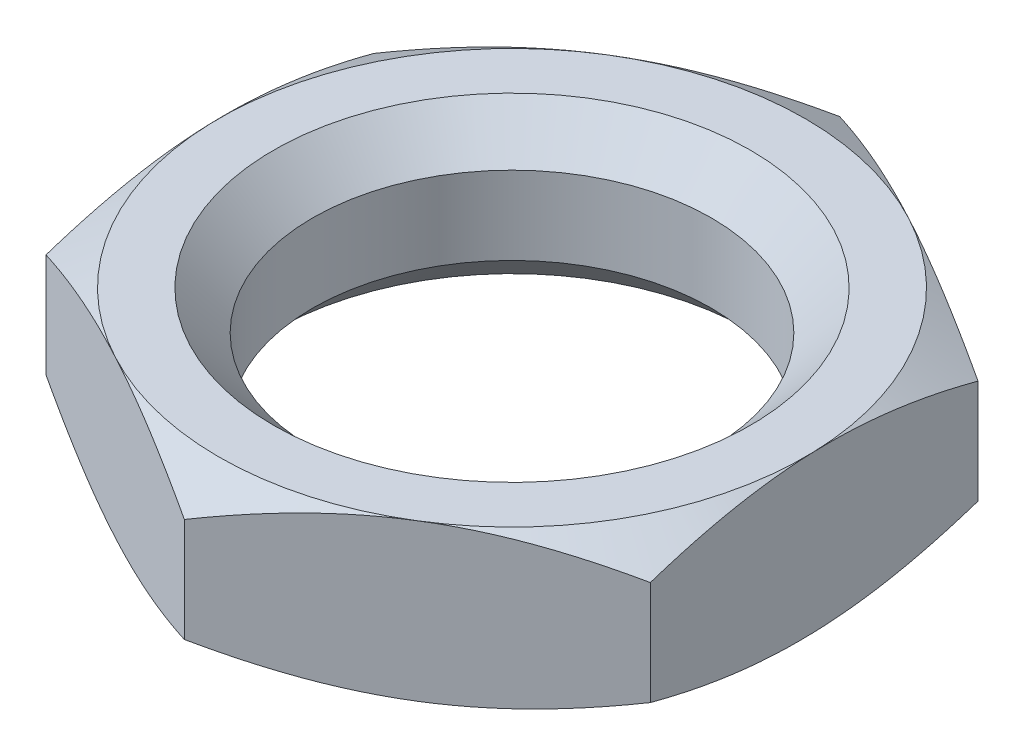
ISO-10303-21;
HEADER;
FILE_DESCRIPTION(('STEP AP214'),'2;1');
FILE_NAME('part.step','',(''),(''),'','','');
FILE_SCHEMA(('AUTOMOTIVE_DESIGN { 1 0 10303 214 1 1 1 1 }'));
ENDSEC;
DATA;
#1=APPLICATION_CONTEXT('core data for automotive mechanical design processes');
#2=APPLICATION_PROTOCOL_DEFINITION('international standard','automotive_design',2000,#1);
#3=PRODUCT_CONTEXT('',#1,'mechanical');
#4=PRODUCT('Part','Part','',(#3));
#5=PRODUCT_RELATED_PRODUCT_CATEGORY('part','',(#4));
#6=PRODUCT_DEFINITION_FORMATION('','',#4);
#7=PRODUCT_DEFINITION_CONTEXT('part definition',#1,'design');
#8=PRODUCT_DEFINITION('design','',#6,#7);
#9=PRODUCT_DEFINITION_SHAPE('','',#8);
#10=(LENGTH_UNIT() NAMED_UNIT(*) SI_UNIT(.MILLI.,.METRE.));
#11=(NAMED_UNIT(*) PLANE_ANGLE_UNIT() SI_UNIT($,.RADIAN.));
#12=(NAMED_UNIT(*) SI_UNIT($,.STERADIAN.) SOLID_ANGLE_UNIT());
#13=UNCERTAINTY_MEASURE_WITH_UNIT(LENGTH_MEASURE(1.E-05),#10,'distance_accuracy_value','');
#14=(GEOMETRIC_REPRESENTATION_CONTEXT(3) GLOBAL_UNCERTAINTY_ASSIGNED_CONTEXT((#13)) GLOBAL_UNIT_ASSIGNED_CONTEXT((#10,
#11,#12)) REPRESENTATION_CONTEXT('',''));
#15=CARTESIAN_POINT('',(0.,0.,0.));
#16=DIRECTION('',(0.,0.,1.));
#17=DIRECTION('',(1.,0.,0.));
#18=AXIS2_PLACEMENT_3D('',#15,#16,#17);
#19=CARTESIAN_POINT('',(7.63223412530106,4.,4.09255449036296));
#20=DIRECTION('',(-0.999507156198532,0.,0.0313917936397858));
#21=DIRECTION('',(0.0313917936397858,0.,0.999507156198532));
#22=AXIS2_PLACEMENT_3D('',#19,#20,#21);
#23=PLANE('',#22);
#24=CARTESIAN_POINT('',(7.36036693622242,0.669930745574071,-4.56363139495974));
#25=CARTESIAN_POINT('',(7.36634273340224,0.614986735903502,-4.37336345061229));
#26=CARTESIAN_POINT('',(7.37234081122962,0.56253632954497,-4.18238609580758));
#27=CARTESIAN_POINT('',(7.38438567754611,0.463309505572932,-3.79888045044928));
#28=CARTESIAN_POINT('',(7.39043248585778,0.416535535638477,-3.6063515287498));
#29=CARTESIAN_POINT('',(7.40866972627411,0.285646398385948,-3.02568218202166));
#30=CARTESIAN_POINT('',(7.42093214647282,0.211198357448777,-2.63524967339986));
#31=CARTESIAN_POINT('',(7.43928263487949,0.123899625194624,-2.05097453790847));
#32=CARTESIAN_POINT('',(7.44531587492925,0.099030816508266,-1.85887762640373));
#33=CARTESIAN_POINT('',(7.45740961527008,0.0573296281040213,-1.47381584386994));
#34=CARTESIAN_POINT('',(7.46347011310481,0.0404965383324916,-1.28085105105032));
#35=CARTESIAN_POINT('',(7.47560163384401,0.0152957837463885,-0.894586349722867));
#36=CARTESIAN_POINT('',(7.48167263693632,0.00691851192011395,-0.701287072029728));
#37=CARTESIAN_POINT('',(7.49381991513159,-0.00119996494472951,-0.314520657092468));
#38=CARTESIAN_POINT('',(7.49989619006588,-0.000941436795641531,-0.12105352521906));
#39=CARTESIAN_POINT('',(7.51654297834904,0.0116370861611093,0.408976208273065));
#40=CARTESIAN_POINT('',(7.52710804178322,0.0327508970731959,0.745365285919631));
#41=CARTESIAN_POINT('',(7.54816799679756,0.0997014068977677,1.41590918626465));
#42=CARTESIAN_POINT('',(7.5586628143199,0.145560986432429,1.75006165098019));
#43=CARTESIAN_POINT('',(7.57976514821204,0.260196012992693,2.42195488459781));
#44=CARTESIAN_POINT('',(7.59037000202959,0.329457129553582,2.75961087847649));
#45=CARTESIAN_POINT('',(7.61142156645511,0.486651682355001,3.42988762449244));
#46=CARTESIAN_POINT('',(7.62186854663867,0.574548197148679,3.76251695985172));
#47=CARTESIAN_POINT('',(7.63224040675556,0.669930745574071,4.09275449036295));
#48=B_SPLINE_CURVE_WITH_KNOTS('',3,(#24,#25,#26,#27,#28,#29,#30,#31,#32,#33,#34,#35,#36,#37,#38,
#39,#40,#41,#42,#43,#44,#45,#46,#47),.UNSPECIFIED.,.F.,.F.,(4,2,2,2,2,2,2,2,2,2,2,4),(0.,
0.594349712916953,1.18895480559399,2.38063565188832,2.96188168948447,3.54307635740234,
4.12360995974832,4.70412562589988,5.71471502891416,6.72624045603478,7.76019940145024,
8.79212864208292),.UNSPECIFIED.);
#49=CARTESIAN_POINT('',(7.36037321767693,0.669872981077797,-4.56343139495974));
#50=VERTEX_POINT('',#49);
#51=CARTESIAN_POINT('',(7.49630367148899,0.,-0.235438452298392));
#52=VERTEX_POINT('',#51);
#53=EDGE_CURVE('E364',#50,#52,#48,.T.);
#54=ORIENTED_EDGE('',*,*,#53,.F.);
#55=DIRECTION('',(0.,-1.,0.));
#56=VECTOR('',#55,1.);
#57=CARTESIAN_POINT('',(7.36037321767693,4.,-4.56343139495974));
#58=LINE('',#57,#56);
#59=CARTESIAN_POINT('',(7.36037321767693,3.3301270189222,-4.56343139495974));
#60=VERTEX_POINT('',#59);
#61=EDGE_CURVE('E481',#60,#50,#58,.T.);
#62=ORIENTED_EDGE('',*,*,#61,.F.);
#63=CARTESIAN_POINT('',(7.63224040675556,3.33006925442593,4.09275449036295));
#64=CARTESIAN_POINT('',(7.62626460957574,3.3850132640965,3.90248654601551));
#65=CARTESIAN_POINT('',(7.62026653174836,3.43746367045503,3.71150919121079));
#66=CARTESIAN_POINT('',(7.60822166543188,3.53669049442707,3.3280035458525));
#67=CARTESIAN_POINT('',(7.6021748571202,3.58346446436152,3.13547462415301));
#68=CARTESIAN_POINT('',(7.58393761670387,3.71435360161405,2.55480527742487));
#69=CARTESIAN_POINT('',(7.57167519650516,3.78880164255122,2.16437276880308));
#70=CARTESIAN_POINT('',(7.55332470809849,3.87610037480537,1.58009763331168));
#71=CARTESIAN_POINT('',(7.54729146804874,3.90096918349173,1.38800072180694));
#72=CARTESIAN_POINT('',(7.5351977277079,3.94267037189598,1.00293893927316));
#73=CARTESIAN_POINT('',(7.52913722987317,3.95950346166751,0.809974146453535));
#74=CARTESIAN_POINT('',(7.51700570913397,3.98470421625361,0.423709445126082));
#75=CARTESIAN_POINT('',(7.51093470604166,3.99308148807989,0.230410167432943));
#76=CARTESIAN_POINT('',(7.49878742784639,4.00119996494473,-0.156356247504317));
#77=CARTESIAN_POINT('',(7.4927111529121,4.00094143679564,-0.349823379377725));
#78=CARTESIAN_POINT('',(7.47606436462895,3.98836291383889,-0.879853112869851));
#79=CARTESIAN_POINT('',(7.46549930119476,3.9672491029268,-1.21624219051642));
#80=CARTESIAN_POINT('',(7.44443934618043,3.90029859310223,-1.88678609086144));
#81=CARTESIAN_POINT('',(7.43394452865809,3.85443901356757,-2.22093855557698));
#82=CARTESIAN_POINT('',(7.41284219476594,3.7398039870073,-2.8928317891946));
#83=CARTESIAN_POINT('',(7.40223734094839,3.67054287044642,-3.23048778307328));
#84=CARTESIAN_POINT('',(7.38118577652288,3.513348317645,-3.90076452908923));
#85=CARTESIAN_POINT('',(7.37073879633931,3.42545180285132,-4.23339386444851));
#86=CARTESIAN_POINT('',(7.36036693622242,3.33006925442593,-4.56363139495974));
#87=B_SPLINE_CURVE_WITH_KNOTS('',3,(#63,#64,#65,#66,#67,#68,#69,#70,#71,#72,#73,#74,#75,#76,#77,
#78,#79,#80,#81,#82,#83,#84,#85,#86),.UNSPECIFIED.,.F.,.F.,(4,2,2,2,2,2,2,2,2,2,2,4),(0.,
0.594349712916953,1.18895480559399,2.38063565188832,2.96188168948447,3.54307635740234,
4.12360995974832,4.70412562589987,5.71471502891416,6.72624045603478,7.76019940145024,
8.79212864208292),.UNSPECIFIED.);
#88=CARTESIAN_POINT('',(7.49630367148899,4.,-0.235438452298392));
#89=VERTEX_POINT('',#88);
#90=EDGE_CURVE('E578',#89,#60,#87,.T.);
#91=ORIENTED_EDGE('',*,*,#90,.F.);
#92=CARTESIAN_POINT('',(7.63223412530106,3.3301270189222,4.09255449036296));
#93=VERTEX_POINT('',#92);
#94=EDGE_CURVE('E472',#93,#89,#87,.T.);
#95=ORIENTED_EDGE('',*,*,#94,.F.);
#96=DIRECTION('',(0.,-1.,0.));
#97=VECTOR('',#96,1.);
#98=CARTESIAN_POINT('',(7.63223412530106,4.,4.09255449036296));
#99=LINE('',#98,#97);
#100=CARTESIAN_POINT('',(7.63223412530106,0.669872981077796,4.09255449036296));
#101=VERTEX_POINT('',#100);
#102=EDGE_CURVE('E467',#93,#101,#99,.T.);
#103=ORIENTED_EDGE('',*,*,#102,.T.);
#104=EDGE_CURVE('E459',#52,#101,#48,.T.);
#105=ORIENTED_EDGE('',*,*,#104,.F.);
#106=EDGE_LOOP('',(#54,#62,#91,#95,#103,#105));
#107=FACE_BOUND('',#106,.T.);
#108=ADVANCED_FACE('F348',(#107),#23,.F.);
#109=CARTESIAN_POINT('',(7.36037321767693,4.,-4.56343139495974));
#110=DIRECTION('',(-0.472567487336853,0.,0.881294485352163));
#111=DIRECTION('',(0.881294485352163,0.,0.472567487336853));
#112=AXIS2_PLACEMENT_3D('',#109,#110,#111);
#113=PLANE('',#112);
#114=CARTESIAN_POINT('',(-0.272060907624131,0.669938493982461,-8.65609312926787));
#115=CARTESIAN_POINT('',(-0.104295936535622,0.61499416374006,-8.56613424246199));
#116=CARTESIAN_POINT('',(0.0640945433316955,0.562543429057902,-8.47583994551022));
#117=CARTESIAN_POINT('',(0.402243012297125,0.463315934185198,-8.29451806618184));
#118=CARTESIAN_POINT('',(0.572001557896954,0.416541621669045,-8.20349018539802));
#119=CARTESIAN_POINT('',(1.08399521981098,0.285651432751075,-7.92894908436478));
#120=CARTESIAN_POINT('',(1.42825134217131,0.211202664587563,-7.74435216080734));
#121=CARTESIAN_POINT('',(1.9434243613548,0.123902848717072,-7.46810622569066));
#122=CARTESIAN_POINT('',(2.11280199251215,0.0990336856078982,-7.37728259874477));
#123=CARTESIAN_POINT('',(2.45232257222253,0.0573317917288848,-7.19522496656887));
#124=CARTESIAN_POINT('',(2.62246545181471,0.0404983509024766,-7.10399099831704));
#125=CARTESIAN_POINT('',(2.96304670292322,0.0152969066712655,-6.92136461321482));
#126=CARTESIAN_POINT('',(3.13348451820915,0.00691929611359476,-6.82997249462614));
#127=CARTESIAN_POINT('',(3.47450816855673,-0.00119983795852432,-6.64710888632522));
#128=CARTESIAN_POINT('',(3.64509399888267,-0.000941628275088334,-6.55563739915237));
#129=CARTESIAN_POINT('',(4.11244035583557,0.0116361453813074,-6.30503706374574));
#130=CARTESIAN_POINT('',(4.40904788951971,0.0327498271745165,-6.14599025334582));
#131=CARTESIAN_POINT('',(5.00029292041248,0.099700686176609,-5.82895300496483));
#132=CARTESIAN_POINT('',(5.29492833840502,0.145560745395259,-5.67096368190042));
#133=CARTESIAN_POINT('',(5.88736318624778,0.260197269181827,-5.35328843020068));
#134=CARTESIAN_POINT('',(6.18508786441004,0.329459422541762,-5.19364258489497));
#135=CARTESIAN_POINT('',(6.77609738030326,0.486656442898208,-4.87673162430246));
#136=CARTESIAN_POINT('',(7.06938978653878,0.574554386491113,-4.71946245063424));
#137=CARTESIAN_POINT('',(7.36057321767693,0.669938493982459,-4.56332415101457));
#138=B_SPLINE_CURVE_WITH_KNOTS('',3,(#114,#115,#116,#117,#118,#119,#120,#121,#122,#123,#124,
#125,#126,#127,#128,#129,#130,#131,#132,#133,#134,#135,#136,#137),.UNSPECIFIED.,.F.,.F.,(4,2,2,
2,2,2,2,2,2,2,2,4),(0.,0.594350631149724,1.18895664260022,2.380639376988,2.96188624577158,
3.54308174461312,4.12361616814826,4.70413265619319,5.71473393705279,6.72627128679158,
7.76024278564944,8.79218449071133),.UNSPECIFIED.);
#139=CARTESIAN_POINT('',(-0.271860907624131,0.669872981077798,-8.65598588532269));
#140=VERTEX_POINT('',#139);
#141=CARTESIAN_POINT('',(3.5442561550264,0.,-6.60970864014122));
#142=VERTEX_POINT('',#141);
#143=EDGE_CURVE('E371',#140,#142,#138,.T.);
#144=ORIENTED_EDGE('',*,*,#143,.F.);
#145=DIRECTION('',(0.,-1.,0.));
#146=VECTOR('',#145,1.);
#147=CARTESIAN_POINT('',(-0.271860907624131,4.,-8.65598588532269));
#148=LINE('',#147,#146);
#149=CARTESIAN_POINT('',(-0.271860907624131,3.3301270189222,-8.65598588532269));
#150=VERTEX_POINT('',#149);
#151=EDGE_CURVE('E478',#150,#140,#148,.T.);
#152=ORIENTED_EDGE('',*,*,#151,.F.);
#153=CARTESIAN_POINT('',(7.36057321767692,3.33006150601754,-4.56332415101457));
#154=CARTESIAN_POINT('',(7.19280824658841,3.38500583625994,-4.65328303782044));
#155=CARTESIAN_POINT('',(7.0244177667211,3.4374565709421,-4.74357733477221));
#156=CARTESIAN_POINT('',(6.68626929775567,3.5366840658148,-4.9248992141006));
#157=CARTESIAN_POINT('',(6.51651075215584,3.58345837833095,-5.01592709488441));
#158=CARTESIAN_POINT('',(6.00451709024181,3.71434856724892,-5.29046819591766));
#159=CARTESIAN_POINT('',(5.66026096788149,3.78879733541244,-5.4750651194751));
#160=CARTESIAN_POINT('',(5.14508794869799,3.87609715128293,-5.75131105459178));
#161=CARTESIAN_POINT('',(4.97571031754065,3.9009663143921,-5.84213468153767));
#162=CARTESIAN_POINT('',(4.63618973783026,3.94266820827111,-6.02419231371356));
#163=CARTESIAN_POINT('',(4.46604685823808,3.95950164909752,-6.11542628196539));
#164=CARTESIAN_POINT('',(4.12546560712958,3.98470309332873,-6.29805266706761));
#165=CARTESIAN_POINT('',(3.95502779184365,3.9930807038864,-6.3894447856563));
#166=CARTESIAN_POINT('',(3.61400414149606,4.00119983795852,-6.57230839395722));
#167=CARTESIAN_POINT('',(3.44341831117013,4.00094162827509,-6.66377988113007));
#168=CARTESIAN_POINT('',(2.97607195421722,3.98836385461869,-6.9143802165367));
#169=CARTESIAN_POINT('',(2.67946442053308,3.96725017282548,-7.07342702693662));
#170=CARTESIAN_POINT('',(2.08821938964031,3.90029931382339,-7.39046427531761));
#171=CARTESIAN_POINT('',(1.79358397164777,3.85443925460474,-7.54845359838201));
#172=CARTESIAN_POINT('',(1.20114912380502,3.73980273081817,-7.86612885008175));
#173=CARTESIAN_POINT('',(0.903424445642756,3.67054057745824,-8.02577469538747));
#174=CARTESIAN_POINT('',(0.312414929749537,3.51334355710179,-8.34268565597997));
#175=CARTESIAN_POINT('',(0.0191225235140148,3.42544561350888,-8.4999548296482));
#176=CARTESIAN_POINT('',(-0.272060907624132,3.33006150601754,-8.65609312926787));
#177=B_SPLINE_CURVE_WITH_KNOTS('',3,(#153,#154,#155,#156,#157,#158,#159,#160,#161,#162,#163,
#164,#165,#166,#167,#168,#169,#170,#171,#172,#173,#174,#175,#176),.UNSPECIFIED.,.F.,.F.,(4,2,2,
2,2,2,2,2,2,2,2,4),(0.,0.594350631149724,1.18895664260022,2.380639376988,2.96188624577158,
3.54308174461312,4.12361616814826,4.70413265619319,5.71473393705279,6.72627128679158,
7.76024278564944,8.79218449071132),.UNSPECIFIED.);
#178=CARTESIAN_POINT('',(3.5442561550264,4.,-6.60970864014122));
#179=VERTEX_POINT('',#178);
#180=EDGE_CURVE('E572',#179,#150,#177,.T.);
#181=ORIENTED_EDGE('',*,*,#180,.F.);
#182=EDGE_CURVE('E576',#60,#179,#177,.T.);
#183=ORIENTED_EDGE('',*,*,#182,.F.);
#184=ORIENTED_EDGE('',*,*,#61,.T.);
#185=EDGE_CURVE('E590',#142,#50,#138,.T.);
#186=ORIENTED_EDGE('',*,*,#185,.F.);
#187=EDGE_LOOP('',(#144,#152,#181,#183,#184,#186));
#188=FACE_BOUND('',#187,.T.);
#189=ADVANCED_FACE('F582',(#188),#113,.F.);
#190=CARTESIAN_POINT('',(-0.271860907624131,4.,-8.65598588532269));
#191=DIRECTION('',(0.526939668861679,0.,0.849902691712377));
#192=DIRECTION('',(0.849902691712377,0.,-0.526939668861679));
#193=AXIS2_PLACEMENT_3D('',#190,#191,#192);
#194=PLANE('',#193);
#195=CARTESIAN_POINT('',(-7.63243412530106,0.669940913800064,-4.09243049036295));
#196=CARTESIAN_POINT('',(-7.47064489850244,0.614996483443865,-4.1927398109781));
#197=CARTESIAN_POINT('',(-7.30825244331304,0.562545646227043,-4.29342313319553));
#198=CARTESIAN_POINT('',(-6.98214873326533,0.4633179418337,-4.49560743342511));
#199=CARTESIAN_POINT('',(-6.81843694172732,0.416543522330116,-4.59710874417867));
#200=CARTESIAN_POINT('',(-6.32468035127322,0.285653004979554,-4.90323783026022));
#201=CARTESIAN_POINT('',(-5.99268653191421,0.211204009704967,-5.10907399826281));
#202=CARTESIAN_POINT('',(-5.495863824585,0.123903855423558,-5.41710407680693));
#203=CARTESIAN_POINT('',(-5.33251937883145,0.0990345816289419,-5.51837763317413));
#204=CARTESIAN_POINT('',(-5.00509242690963,0.0573324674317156,-5.72138234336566));
#205=CARTESIAN_POINT('',(-4.84100998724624,0.0404989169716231,-5.82311345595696));
#206=CARTESIAN_POINT('',(-4.51256013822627,0.0152972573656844,-6.02675236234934));
#207=CARTESIAN_POINT('',(-4.34819326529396,0.00691954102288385,-6.12865982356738));
#208=CARTESIAN_POINT('',(-4.01931676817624,-0.00119979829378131,-6.33256325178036));
#209=CARTESIAN_POINT('',(-3.85480714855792,-0.000941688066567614,-6.43455921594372));
#210=CARTESIAN_POINT('',(-3.40410658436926,0.0116358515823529,-6.7139935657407));
#211=CARTESIAN_POINT('',(-3.11806318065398,0.0327494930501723,-6.89134047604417));
#212=CARTESIAN_POINT('',(-2.54787624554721,0.0997004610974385,-7.24485637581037));
#213=CARTESIAN_POINT('',(-2.26373471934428,0.145560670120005,-7.42102412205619));
#214=CARTESIAN_POINT('',(-1.69240032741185,0.260197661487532,-7.7752514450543));
#215=CARTESIAN_POINT('',(-1.40527955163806,0.32946013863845,-7.95326632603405));
#216=CARTESIAN_POINT('',(-0.835319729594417,0.486657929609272,-8.30664141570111));
#217=CARTESIAN_POINT('',(-0.552473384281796,0.574556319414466,-8.48200614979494));
#218=CARTESIAN_POINT('',(-0.27166090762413,0.669940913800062,-8.6561098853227));
#219=B_SPLINE_CURVE_WITH_KNOTS('',3,(#195,#196,#197,#198,#199,#200,#201,#202,#203,#204,#205,
#206,#207,#208,#209,#210,#211,#212,#213,#214,#215,#216,#217,#218),.UNSPECIFIED.,.F.,.F.,(4,2,2,
2,2,2,2,2,2,2,2,4),(0.,0.594350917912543,1.18895721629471,2.38064054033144,2.96188766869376,
3.54308342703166,4.12361810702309,4.70413485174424,5.71473984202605,6.72628091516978,
7.76025633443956,8.79220193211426),.UNSPECIFIED.);
#220=CARTESIAN_POINT('',(-7.63223412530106,0.6698729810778,-4.09255449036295));
#221=VERTEX_POINT('',#220);
#222=CARTESIAN_POINT('',(-3.95204751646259,0.,-6.37427018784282));
#223=VERTEX_POINT('',#222);
#224=EDGE_CURVE('E605',#221,#223,#219,.T.);
#225=ORIENTED_EDGE('',*,*,#224,.F.);
#226=DIRECTION('',(0.,-1.,0.));
#227=VECTOR('',#226,1.);
#228=CARTESIAN_POINT('',(-7.63223412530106,4.,-4.09255449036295));
#229=LINE('',#228,#227);
#230=CARTESIAN_POINT('',(-7.63223412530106,3.3301270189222,-4.09255449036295));
#231=VERTEX_POINT('',#230);
#232=EDGE_CURVE('E469',#231,#221,#229,.T.);
#233=ORIENTED_EDGE('',*,*,#232,.F.);
#234=CARTESIAN_POINT('',(-0.271660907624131,3.33005908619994,-8.6561098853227));
#235=CARTESIAN_POINT('',(-0.433450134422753,3.38500351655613,-8.55580056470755));
#236=CARTESIAN_POINT('',(-0.595842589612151,3.43745435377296,-8.45511724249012));
#237=CARTESIAN_POINT('',(-0.921946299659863,3.5366820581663,-8.25293294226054));
#238=CARTESIAN_POINT('',(-1.08565809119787,3.58345647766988,-8.15143163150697));
#239=CARTESIAN_POINT('',(-1.57941468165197,3.71434699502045,-7.84530254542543));
#240=CARTESIAN_POINT('',(-1.91140850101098,3.78879599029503,-7.63946637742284));
#241=CARTESIAN_POINT('',(-2.40823120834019,3.87609614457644,-7.33143629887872));
#242=CARTESIAN_POINT('',(-2.57157565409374,3.90096541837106,-7.23016274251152));
#243=CARTESIAN_POINT('',(-2.89900260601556,3.94266753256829,-7.02715803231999));
#244=CARTESIAN_POINT('',(-3.06308504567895,3.95950108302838,-6.92542691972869));
#245=CARTESIAN_POINT('',(-3.39153489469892,3.98470274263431,-6.72178801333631));
#246=CARTESIAN_POINT('',(-3.55590176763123,3.99308045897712,-6.61988055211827));
#247=CARTESIAN_POINT('',(-3.88477826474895,4.00119979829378,-6.41597712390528));
#248=CARTESIAN_POINT('',(-4.04928788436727,4.00094168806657,-6.31398115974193));
#249=CARTESIAN_POINT('',(-4.49998844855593,3.98836414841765,-6.03454680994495));
#250=CARTESIAN_POINT('',(-4.7860318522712,3.96725050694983,-5.85719989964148));
#251=CARTESIAN_POINT('',(-5.35621878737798,3.90029953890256,-5.50368399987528));
#252=CARTESIAN_POINT('',(-5.6403603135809,3.85443932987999,-5.32751625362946));
#253=CARTESIAN_POINT('',(-6.21169470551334,3.73980233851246,-4.97328893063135));
#254=CARTESIAN_POINT('',(-6.49881548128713,3.67053986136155,-4.7952740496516));
#255=CARTESIAN_POINT('',(-7.06877530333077,3.51334207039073,-4.44189895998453));
#256=CARTESIAN_POINT('',(-7.35162164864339,3.42544368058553,-4.26653422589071));
#257=CARTESIAN_POINT('',(-7.63243412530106,3.33005908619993,-4.09243049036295));
#258=B_SPLINE_CURVE_WITH_KNOTS('',3,(#234,#235,#236,#237,#238,#239,#240,#241,#242,#243,#244,
#245,#246,#247,#248,#249,#250,#251,#252,#253,#254,#255,#256,#257),.UNSPECIFIED.,.F.,.F.,(4,2,2,
2,2,2,2,2,2,2,2,4),(0.,0.594350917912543,1.18895721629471,2.38064054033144,2.96188766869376,
3.54308342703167,4.12361810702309,4.70413485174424,5.71473984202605,6.72628091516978,
7.76025633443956,8.79220193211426),.UNSPECIFIED.);
#259=CARTESIAN_POINT('',(-3.95204751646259,4.,-6.37427018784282));
#260=VERTEX_POINT('',#259);
#261=EDGE_CURVE('E529',#260,#231,#258,.T.);
#262=ORIENTED_EDGE('',*,*,#261,.F.);
#263=EDGE_CURVE('E577',#150,#260,#258,.T.);
#264=ORIENTED_EDGE('',*,*,#263,.F.);
#265=ORIENTED_EDGE('',*,*,#151,.T.);
#266=EDGE_CURVE('E601',#223,#140,#219,.T.);
#267=ORIENTED_EDGE('',*,*,#266,.F.);
#268=EDGE_LOOP('',(#225,#233,#262,#264,#265,#267));
#269=FACE_BOUND('',#268,.T.);
#270=ADVANCED_FACE('F585',(#269),#194,.F.);
#271=CARTESIAN_POINT('',(-7.63223412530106,4.,-4.09255449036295));
#272=DIRECTION('',(0.999507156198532,0.,-0.031391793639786));
#273=DIRECTION('',(-0.031391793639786,0.,-0.999507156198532));
#274=AXIS2_PLACEMENT_3D('',#271,#272,#273);
#275=PLANE('',#274);
#276=CARTESIAN_POINT('',(-7.36036693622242,0.669930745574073,4.56363139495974));
#277=CARTESIAN_POINT('',(-7.36634273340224,0.614986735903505,4.3733634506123));
#278=CARTESIAN_POINT('',(-7.37234081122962,0.562536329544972,4.18238609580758));
#279=CARTESIAN_POINT('',(-7.3843856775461,0.463309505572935,3.79888045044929));
#280=CARTESIAN_POINT('',(-7.39043248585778,0.416535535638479,3.6063515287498));
#281=CARTESIAN_POINT('',(-7.40866972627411,0.285646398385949,3.02568218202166));
#282=CARTESIAN_POINT('',(-7.42093214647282,0.211198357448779,2.63524967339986));
#283=CARTESIAN_POINT('',(-7.43928263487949,0.123899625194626,2.05097453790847));
#284=CARTESIAN_POINT('',(-7.44531587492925,0.0990308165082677,1.85887762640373));
#285=CARTESIAN_POINT('',(-7.45740961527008,0.0573296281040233,1.47381584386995));
#286=CARTESIAN_POINT('',(-7.46347011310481,0.0404965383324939,1.28085105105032));
#287=CARTESIAN_POINT('',(-7.47560163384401,0.0152957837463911,0.894586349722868));
#288=CARTESIAN_POINT('',(-7.48167263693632,0.0069185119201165,0.70128707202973));
#289=CARTESIAN_POINT('',(-7.49381991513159,-0.00119996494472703,0.314520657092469));
#290=CARTESIAN_POINT('',(-7.49989619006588,-0.000941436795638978,0.121053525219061));
#291=CARTESIAN_POINT('',(-7.51654297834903,0.011637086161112,-0.408976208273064));
#292=CARTESIAN_POINT('',(-7.52710804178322,0.0327508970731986,-0.74536528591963));
#293=CARTESIAN_POINT('',(-7.54816799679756,0.0997014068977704,-1.41590918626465));
#294=CARTESIAN_POINT('',(-7.55866281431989,0.145560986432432,-1.75006165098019));
#295=CARTESIAN_POINT('',(-7.57976514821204,0.260196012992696,-2.42195488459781));
#296=CARTESIAN_POINT('',(-7.59037000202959,0.329457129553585,-2.75961087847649));
#297=CARTESIAN_POINT('',(-7.61142156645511,0.486651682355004,-3.42988762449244));
#298=CARTESIAN_POINT('',(-7.62186854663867,0.574548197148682,-3.76251695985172));
#299=CARTESIAN_POINT('',(-7.63224040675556,0.669930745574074,-4.09275449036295));
#300=B_SPLINE_CURVE_WITH_KNOTS('',3,(#276,#277,#278,#279,#280,#281,#282,#283,#284,#285,#286,
#287,#288,#289,#290,#291,#292,#293,#294,#295,#296,#297,#298,#299),.UNSPECIFIED.,.F.,.F.,(4,2,2,
2,2,2,2,2,2,2,2,4),(0.,0.594349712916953,1.18895480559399,2.38063565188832,2.96188168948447,
3.54307635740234,4.12360995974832,4.70412562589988,5.71471502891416,6.72624045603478,
7.76019940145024,8.79212864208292),.UNSPECIFIED.);
#301=CARTESIAN_POINT('',(-7.36037321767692,0.669872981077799,4.56343139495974));
#302=VERTEX_POINT('',#301);
#303=CARTESIAN_POINT('',(-7.49630367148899,0.,0.235438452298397));
#304=VERTEX_POINT('',#303);
#305=EDGE_CURVE('E596',#302,#304,#300,.T.);
#306=ORIENTED_EDGE('',*,*,#305,.F.);
#307=DIRECTION('',(0.,-1.,0.));
#308=VECTOR('',#307,1.);
#309=CARTESIAN_POINT('',(-7.36037321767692,4.,4.56343139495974));
#310=LINE('',#309,#308);
#311=CARTESIAN_POINT('',(-7.36037321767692,3.3301270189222,4.56343139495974));
#312=VERTEX_POINT('',#311);
#313=EDGE_CURVE('E466',#312,#302,#310,.T.);
#314=ORIENTED_EDGE('',*,*,#313,.F.);
#315=CARTESIAN_POINT('',(-7.63224040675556,3.33006925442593,-4.09275449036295));
#316=CARTESIAN_POINT('',(-7.62626460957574,3.38501326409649,-3.9024865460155));
#317=CARTESIAN_POINT('',(-7.62026653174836,3.43746367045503,-3.71150919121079));
#318=CARTESIAN_POINT('',(-7.60822166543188,3.53669049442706,-3.3280035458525));
#319=CARTESIAN_POINT('',(-7.6021748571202,3.58346446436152,-3.13547462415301));
#320=CARTESIAN_POINT('',(-7.58393761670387,3.71435360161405,-2.55480527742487));
#321=CARTESIAN_POINT('',(-7.57167519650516,3.78880164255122,-2.16437276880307));
#322=CARTESIAN_POINT('',(-7.55332470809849,3.87610037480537,-1.58009763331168));
#323=CARTESIAN_POINT('',(-7.54729146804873,3.90096918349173,-1.38800072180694));
#324=CARTESIAN_POINT('',(-7.5351977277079,3.94267037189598,-1.00293893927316));
#325=CARTESIAN_POINT('',(-7.52913722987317,3.9595034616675,-0.809974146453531));
#326=CARTESIAN_POINT('',(-7.51700570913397,3.98470421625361,-0.423709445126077));
#327=CARTESIAN_POINT('',(-7.51093470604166,3.99308148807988,-0.230410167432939));
#328=CARTESIAN_POINT('',(-7.49878742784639,4.00119996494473,0.156356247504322));
#329=CARTESIAN_POINT('',(-7.4927111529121,4.00094143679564,0.34982337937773));
#330=CARTESIAN_POINT('',(-7.47606436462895,3.98836291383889,0.879853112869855));
#331=CARTESIAN_POINT('',(-7.46549930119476,3.9672491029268,1.21624219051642));
#332=CARTESIAN_POINT('',(-7.44443934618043,3.90029859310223,1.88678609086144));
#333=CARTESIAN_POINT('',(-7.43394452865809,3.85443901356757,2.22093855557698));
#334=CARTESIAN_POINT('',(-7.41284219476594,3.7398039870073,2.8928317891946));
#335=CARTESIAN_POINT('',(-7.40223734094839,3.67054287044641,3.23048778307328));
#336=CARTESIAN_POINT('',(-7.38118577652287,3.513348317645,3.90076452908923));
#337=CARTESIAN_POINT('',(-7.37073879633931,3.42545180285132,4.23339386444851));
#338=CARTESIAN_POINT('',(-7.36036693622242,3.33006925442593,4.56363139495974));
#339=B_SPLINE_CURVE_WITH_KNOTS('',3,(#315,#316,#317,#318,#319,#320,#321,#322,#323,#324,#325,
#326,#327,#328,#329,#330,#331,#332,#333,#334,#335,#336,#337,#338),.UNSPECIFIED.,.F.,.F.,(4,2,2,
2,2,2,2,2,2,2,2,4),(0.,0.594349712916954,1.18895480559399,2.38063565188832,2.96188168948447,
3.54307635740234,4.12360995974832,4.70412562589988,5.71471502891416,6.72624045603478,
7.76019940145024,8.79212864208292),.UNSPECIFIED.);
#340=CARTESIAN_POINT('',(-7.49630367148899,4.,0.235438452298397));
#341=VERTEX_POINT('',#340);
#342=EDGE_CURVE('E520',#341,#312,#339,.T.);
#343=ORIENTED_EDGE('',*,*,#342,.F.);
#344=EDGE_CURVE('E523',#231,#341,#339,.T.);
#345=ORIENTED_EDGE('',*,*,#344,.F.);
#346=ORIENTED_EDGE('',*,*,#232,.T.);
#347=EDGE_CURVE('E606',#304,#221,#300,.T.);
#348=ORIENTED_EDGE('',*,*,#347,.F.);
#349=EDGE_LOOP('',(#306,#314,#343,#345,#346,#348));
#350=FACE_BOUND('',#349,.T.);
#351=ADVANCED_FACE('F522',(#350),#275,.F.);
#352=CARTESIAN_POINT('',(-7.36037321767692,4.,4.56343139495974));
#353=DIRECTION('',(0.472567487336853,0.,-0.881294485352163));
#354=DIRECTION('',(-0.881294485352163,0.,-0.472567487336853));
#355=AXIS2_PLACEMENT_3D('',#352,#353,#354);
#356=PLANE('',#355);
#357=CARTESIAN_POINT('',(0.272060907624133,0.669938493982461,8.65609312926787));
#358=CARTESIAN_POINT('',(0.104295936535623,0.614994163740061,8.566134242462));
#359=CARTESIAN_POINT('',(-0.064094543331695,0.562543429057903,8.47583994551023));
#360=CARTESIAN_POINT('',(-0.402243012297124,0.463315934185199,8.29451806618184));
#361=CARTESIAN_POINT('',(-0.572001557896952,0.416541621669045,8.20349018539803));
#362=CARTESIAN_POINT('',(-1.08399521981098,0.285651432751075,7.92894908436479));
#363=CARTESIAN_POINT('',(-1.42825134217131,0.211202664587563,7.74435216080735));
#364=CARTESIAN_POINT('',(-1.9434243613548,0.123902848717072,7.46810622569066));
#365=CARTESIAN_POINT('',(-2.11280199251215,0.0990336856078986,7.37728259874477));
#366=CARTESIAN_POINT('',(-2.45232257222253,0.0573317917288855,7.19522496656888));
#367=CARTESIAN_POINT('',(-2.62246545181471,0.0404983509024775,7.10399099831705));
#368=CARTESIAN_POINT('',(-2.96304670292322,0.0152969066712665,6.92136461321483));
#369=CARTESIAN_POINT('',(-3.13348451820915,0.00691929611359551,6.82997249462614));
#370=CARTESIAN_POINT('',(-3.47450816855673,-0.00119983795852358,6.64710888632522));
#371=CARTESIAN_POINT('',(-3.64509399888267,-0.000941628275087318,6.55563739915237));
#372=CARTESIAN_POINT('',(-4.11244035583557,0.0116361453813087,6.30503706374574));
#373=CARTESIAN_POINT('',(-4.40904788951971,0.0327498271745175,6.14599025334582));
#374=CARTESIAN_POINT('',(-5.00029292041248,0.0997006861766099,5.82895300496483));
#375=CARTESIAN_POINT('',(-5.29492833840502,0.14556074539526,5.67096368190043));
#376=CARTESIAN_POINT('',(-5.88736318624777,0.260197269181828,5.35328843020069));
#377=CARTESIAN_POINT('',(-6.18508786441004,0.329459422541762,5.19364258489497));
#378=CARTESIAN_POINT('',(-6.77609738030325,0.486656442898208,4.87673162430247));
#379=CARTESIAN_POINT('',(-7.06938978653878,0.574554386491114,4.71946245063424));
#380=CARTESIAN_POINT('',(-7.36057321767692,0.669938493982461,4.56332415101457));
#381=B_SPLINE_CURVE_WITH_KNOTS('',3,(#357,#358,#359,#360,#361,#362,#363,#364,#365,#366,#367,
#368,#369,#370,#371,#372,#373,#374,#375,#376,#377,#378,#379,#380),.UNSPECIFIED.,.F.,.F.,(4,2,2,
2,2,2,2,2,2,2,2,4),(0.,0.594350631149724,1.18895664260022,2.380639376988,2.96188624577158,
3.54308174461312,4.12361616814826,4.70413265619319,5.71473393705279,6.72627128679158,
7.76024278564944,8.79218449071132),.UNSPECIFIED.);
#382=CARTESIAN_POINT('',(0.271860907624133,0.669872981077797,8.6559858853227));
#383=VERTEX_POINT('',#382);
#384=CARTESIAN_POINT('',(-3.54425615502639,0.,6.60970864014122));
#385=VERTEX_POINT('',#384);
#386=EDGE_CURVE('E442',#383,#385,#381,.T.);
#387=ORIENTED_EDGE('',*,*,#386,.F.);
#388=DIRECTION('',(0.,-1.,0.));
#389=VECTOR('',#388,1.);
#390=CARTESIAN_POINT('',(0.271860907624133,4.,8.6559858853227));
#391=LINE('',#390,#389);
#392=CARTESIAN_POINT('',(0.271860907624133,3.3301270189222,8.6559858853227));
#393=VERTEX_POINT('',#392);
#394=EDGE_CURVE('E456',#393,#383,#391,.T.);
#395=ORIENTED_EDGE('',*,*,#394,.F.);
#396=CARTESIAN_POINT('',(-7.36057321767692,3.33006150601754,4.56332415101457));
#397=CARTESIAN_POINT('',(-7.19280824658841,3.38500583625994,4.65328303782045));
#398=CARTESIAN_POINT('',(-7.0244177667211,3.43745657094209,4.74357733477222));
#399=CARTESIAN_POINT('',(-6.68626929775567,3.5366840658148,4.9248992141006));
#400=CARTESIAN_POINT('',(-6.51651075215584,3.58345837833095,5.01592709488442));
#401=CARTESIAN_POINT('',(-6.00451709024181,3.71434856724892,5.29046819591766));
#402=CARTESIAN_POINT('',(-5.66026096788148,3.78879733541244,5.4750651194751));
#403=CARTESIAN_POINT('',(-5.14508794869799,3.87609715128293,5.75131105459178));
#404=CARTESIAN_POINT('',(-4.97571031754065,3.9009663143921,5.84213468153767));
#405=CARTESIAN_POINT('',(-4.63618973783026,3.94266820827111,6.02419231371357));
#406=CARTESIAN_POINT('',(-4.46604685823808,3.95950164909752,6.1154262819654));
#407=CARTESIAN_POINT('',(-4.12546560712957,3.98470309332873,6.29805266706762));
#408=CARTESIAN_POINT('',(-3.95502779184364,3.9930807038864,6.3894447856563));
#409=CARTESIAN_POINT('',(-3.61400414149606,4.00119983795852,6.57230839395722));
#410=CARTESIAN_POINT('',(-3.44341831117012,4.00094162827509,6.66377988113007));
#411=CARTESIAN_POINT('',(-2.97607195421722,3.98836385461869,6.9143802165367));
#412=CARTESIAN_POINT('',(-2.67946442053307,3.96725017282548,7.07342702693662));
#413=CARTESIAN_POINT('',(-2.08821938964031,3.90029931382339,7.39046427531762));
#414=CARTESIAN_POINT('',(-1.79358397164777,3.85443925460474,7.54845359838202));
#415=CARTESIAN_POINT('',(-1.20114912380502,3.73980273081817,7.86612885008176));
#416=CARTESIAN_POINT('',(-0.903424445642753,3.67054057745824,8.02577469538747));
#417=CARTESIAN_POINT('',(-0.312414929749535,3.51334355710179,8.34268565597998));
#418=CARTESIAN_POINT('',(-0.0191225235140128,3.42544561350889,8.4999548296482));
#419=CARTESIAN_POINT('',(0.272060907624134,3.33006150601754,8.65609312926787));
#420=B_SPLINE_CURVE_WITH_KNOTS('',3,(#396,#397,#398,#399,#400,#401,#402,#403,#404,#405,#406,
#407,#408,#409,#410,#411,#412,#413,#414,#415,#416,#417,#418,#419),.UNSPECIFIED.,.F.,.F.,(4,2,2,
2,2,2,2,2,2,2,2,4),(0.,0.594350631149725,1.18895664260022,2.380639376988,2.96188624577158,
3.54308174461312,4.12361616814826,4.70413265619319,5.71473393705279,6.72627128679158,
7.76024278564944,8.79218449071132),.UNSPECIFIED.);
#421=CARTESIAN_POINT('',(-3.54425615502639,4.,6.60970864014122));
#422=VERTEX_POINT('',#421);
#423=EDGE_CURVE('E530',#422,#393,#420,.T.);
#424=ORIENTED_EDGE('',*,*,#423,.F.);
#425=EDGE_CURVE('E527',#312,#422,#420,.T.);
#426=ORIENTED_EDGE('',*,*,#425,.F.);
#427=ORIENTED_EDGE('',*,*,#313,.T.);
#428=EDGE_CURVE('E458',#385,#302,#381,.T.);
#429=ORIENTED_EDGE('',*,*,#428,.F.);
#430=EDGE_LOOP('',(#387,#395,#424,#426,#427,#429));
#431=FACE_BOUND('',#430,.T.);
#432=ADVANCED_FACE('F454',(#431),#356,.F.);
#433=CARTESIAN_POINT('',(0.271860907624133,4.,8.6559858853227));
#434=DIRECTION('',(-0.526939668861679,0.,-0.849902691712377));
#435=DIRECTION('',(-0.849902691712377,0.,0.52693966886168));
#436=AXIS2_PLACEMENT_3D('',#433,#434,#435);
#437=PLANE('',#436);
#438=CARTESIAN_POINT('',(7.63243412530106,0.669940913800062,4.09243049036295));
#439=CARTESIAN_POINT('',(7.47064489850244,0.614996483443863,4.1927398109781));
#440=CARTESIAN_POINT('',(7.30825244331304,0.562545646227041,4.29342313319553));
#441=CARTESIAN_POINT('',(6.98214873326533,0.463317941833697,4.49560743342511));
#442=CARTESIAN_POINT('',(6.81843694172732,0.416543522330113,4.59710874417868));
#443=CARTESIAN_POINT('',(6.32468035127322,0.285653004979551,4.90323783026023));
#444=CARTESIAN_POINT('',(5.99268653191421,0.211204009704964,5.10907399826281));
#445=CARTESIAN_POINT('',(5.495863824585,0.123903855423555,5.41710407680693));
#446=CARTESIAN_POINT('',(5.33251937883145,0.0990345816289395,5.51837763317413));
#447=CARTESIAN_POINT('',(5.00509242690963,0.0573324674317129,5.72138234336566));
#448=CARTESIAN_POINT('',(4.84100998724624,0.0404989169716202,5.82311345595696));
#449=CARTESIAN_POINT('',(4.51256013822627,0.0152972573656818,6.02675236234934));
#450=CARTESIAN_POINT('',(4.34819326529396,0.00691954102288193,6.12865982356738));
#451=CARTESIAN_POINT('',(4.01931676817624,-0.0011997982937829,6.33256325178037));
#452=CARTESIAN_POINT('',(3.85480714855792,-0.00094168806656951,6.43455921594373));
#453=CARTESIAN_POINT('',(3.40410658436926,0.0116358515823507,6.7139935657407));
#454=CARTESIAN_POINT('',(3.11806318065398,0.0327494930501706,6.89134047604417));
#455=CARTESIAN_POINT('',(2.54787624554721,0.0997004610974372,7.24485637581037));
#456=CARTESIAN_POINT('',(2.26373471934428,0.145560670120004,7.42102412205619));
#457=CARTESIAN_POINT('',(1.69240032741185,0.260197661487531,7.77525144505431));
#458=CARTESIAN_POINT('',(1.40527955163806,0.329460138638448,7.95326632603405));
#459=CARTESIAN_POINT('',(0.835319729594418,0.486657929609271,8.30664141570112));
#460=CARTESIAN_POINT('',(0.552473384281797,0.574556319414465,8.48200614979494));
#461=CARTESIAN_POINT('',(0.271660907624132,0.669940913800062,8.6561098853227));
#462=B_SPLINE_CURVE_WITH_KNOTS('',3,(#438,#439,#440,#441,#442,#443,#444,#445,#446,#447,#448,
#449,#450,#451,#452,#453,#454,#455,#456,#457,#458,#459,#460,#461),.UNSPECIFIED.,.F.,.F.,(4,2,2,
2,2,2,2,2,2,2,2,4),(0.,0.594350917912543,1.18895721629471,2.38064054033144,2.96188766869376,
3.54308342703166,4.12361810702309,4.70413485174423,5.71473984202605,6.72628091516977,
7.76025633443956,8.79220193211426),.UNSPECIFIED.);
#463=CARTESIAN_POINT('',(3.9520475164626,0.,6.37427018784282));
#464=VERTEX_POINT('',#463);
#465=EDGE_CURVE('E448',#101,#464,#462,.T.);
#466=ORIENTED_EDGE('',*,*,#465,.F.);
#467=ORIENTED_EDGE('',*,*,#102,.F.);
#468=CARTESIAN_POINT('',(0.271660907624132,3.33005908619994,8.6561098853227));
#469=CARTESIAN_POINT('',(0.433450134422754,3.38500351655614,8.55580056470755));
#470=CARTESIAN_POINT('',(0.595842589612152,3.43745435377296,8.45511724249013));
#471=CARTESIAN_POINT('',(0.921946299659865,3.5366820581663,8.25293294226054));
#472=CARTESIAN_POINT('',(1.08565809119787,3.58345647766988,8.15143163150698));
#473=CARTESIAN_POINT('',(1.57941468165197,3.71434699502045,7.84530254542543));
#474=CARTESIAN_POINT('',(1.91140850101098,3.78879599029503,7.63946637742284));
#475=CARTESIAN_POINT('',(2.40823120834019,3.87609614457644,7.33143629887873));
#476=CARTESIAN_POINT('',(2.57157565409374,3.90096541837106,7.23016274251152));
#477=CARTESIAN_POINT('',(2.89900260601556,3.94266753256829,7.02715803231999));
#478=CARTESIAN_POINT('',(3.06308504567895,3.95950108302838,6.92542691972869));
#479=CARTESIAN_POINT('',(3.39153489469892,3.98470274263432,6.72178801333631));
#480=CARTESIAN_POINT('',(3.55590176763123,3.99308045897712,6.61988055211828));
#481=CARTESIAN_POINT('',(3.88477826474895,4.00119979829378,6.41597712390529));
#482=CARTESIAN_POINT('',(4.04928788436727,4.00094168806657,6.31398115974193));
#483=CARTESIAN_POINT('',(4.49998844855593,3.98836414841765,6.03454680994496));
#484=CARTESIAN_POINT('',(4.78603185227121,3.96725050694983,5.85719989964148));
#485=CARTESIAN_POINT('',(5.35621878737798,3.90029953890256,5.50368399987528));
#486=CARTESIAN_POINT('',(5.6403603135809,3.85443932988,5.32751625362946));
#487=CARTESIAN_POINT('',(6.21169470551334,3.73980233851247,4.97328893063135));
#488=CARTESIAN_POINT('',(6.49881548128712,3.67053986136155,4.7952740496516));
#489=CARTESIAN_POINT('',(7.06877530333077,3.51334207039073,4.44189895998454));
#490=CARTESIAN_POINT('',(7.35162164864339,3.42544368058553,4.26653422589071));
#491=CARTESIAN_POINT('',(7.63243412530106,3.33005908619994,4.09243049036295));
#492=B_SPLINE_CURVE_WITH_KNOTS('',3,(#468,#469,#470,#471,#472,#473,#474,#475,#476,#477,#478,
#479,#480,#481,#482,#483,#484,#485,#486,#487,#488,#489,#490,#491),.UNSPECIFIED.,.F.,.F.,(4,2,2,
2,2,2,2,2,2,2,2,4),(0.,0.594350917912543,1.18895721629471,2.38064054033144,2.96188766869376,
3.54308342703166,4.12361810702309,4.70413485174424,5.71473984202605,6.72628091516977,
7.76025633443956,8.79220193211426),.UNSPECIFIED.);
#493=CARTESIAN_POINT('',(3.9520475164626,4.,6.37427018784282));
#494=VERTEX_POINT('',#493);
#495=EDGE_CURVE('E563',#494,#93,#492,.T.);
#496=ORIENTED_EDGE('',*,*,#495,.F.);
#497=EDGE_CURVE('E465',#393,#494,#492,.T.);
#498=ORIENTED_EDGE('',*,*,#497,.F.);
#499=ORIENTED_EDGE('',*,*,#394,.T.);
#500=EDGE_CURVE('E439',#464,#383,#462,.T.);
#501=ORIENTED_EDGE('',*,*,#500,.F.);
#502=EDGE_LOOP('',(#466,#467,#496,#498,#499,#501));
#503=FACE_BOUND('',#502,.T.);
#504=ADVANCED_FACE('F462',(#503),#437,.F.);
#505=CARTESIAN_POINT('',(7.08851231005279,0.,-13.2194172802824));
#506=DIRECTION('',(0.,1.,0.));
#507=DIRECTION('',(0.,0.,1.));
#508=AXIS2_PLACEMENT_3D('',#505,#506,#507);
#509=PLANE('',#508);
#510=CARTESIAN_POINT('',(0.,0.,0.));
#511=DIRECTION('',(0.,1.,0.));
#512=DIRECTION('',(0.,0.,1.));
#513=AXIS2_PLACEMENT_3D('',#510,#511,#512);
#514=CIRCLE('',#513,6.1);
#515=CARTESIAN_POINT('',(0.,0.,6.1));
#516=VERTEX_POINT('',#515);
#517=EDGE_CURVE('E484',#516,#516,#514,.T.);
#518=ORIENTED_EDGE('',*,*,#517,.T.);
#519=EDGE_LOOP('',(#518));
#520=FACE_BOUND('',#519,.T.);
#521=CARTESIAN_POINT('',(0.,0.,0.));
#522=DIRECTION('',(0.,1.,0.));
#523=DIRECTION('',(0.,0.,1.));
#524=AXIS2_PLACEMENT_3D('',#521,#522,#523);
#525=CIRCLE('',#524,7.5);
#526=EDGE_CURVE('E11',#464,#52,#525,.T.);
#527=ORIENTED_EDGE('',*,*,#526,.F.);
#528=EDGE_CURVE('E352',#385,#464,#525,.T.);
#529=ORIENTED_EDGE('',*,*,#528,.F.);
#530=EDGE_CURVE('E507',#304,#385,#525,.T.);
#531=ORIENTED_EDGE('',*,*,#530,.F.);
#532=EDGE_CURVE('E614',#223,#304,#525,.T.);
#533=ORIENTED_EDGE('',*,*,#532,.F.);
#534=EDGE_CURVE('E357',#142,#223,#525,.T.);
#535=ORIENTED_EDGE('',*,*,#534,.F.);
#536=CARTESIAN_POINT('',(0.,0.,0.));
#537=DIRECTION('',(0.,-1.,0.));
#538=DIRECTION('',(0.,0.,-1.));
#539=AXIS2_PLACEMENT_3D('',#536,#537,#538);
#540=CIRCLE('',#539,7.5);
#541=EDGE_CURVE('E449',#142,#52,#540,.T.);
#542=ORIENTED_EDGE('',*,*,#541,.T.);
#543=EDGE_LOOP('',(#527,#529,#531,#533,#535,#542));
#544=FACE_BOUND('',#543,.T.);
#545=ADVANCED_FACE('F624',(#520,#544),#509,.F.);
#546=CARTESIAN_POINT('',(7.08851231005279,4.,-13.2194172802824));
#547=DIRECTION('',(0.,1.,0.));
#548=DIRECTION('',(0.,0.,1.));
#549=AXIS2_PLACEMENT_3D('',#546,#547,#548);
#550=PLANE('',#549);
#551=CARTESIAN_POINT('',(0.,4.,0.));
#552=DIRECTION('',(0.,1.,0.));
#553=DIRECTION('',(0.,0.,1.));
#554=AXIS2_PLACEMENT_3D('',#551,#552,#553);
#555=CIRCLE('',#554,6.1);
#556=CARTESIAN_POINT('',(0.,4.,6.1));
#557=VERTEX_POINT('',#556);
#558=EDGE_CURVE('E493',#557,#557,#555,.F.);
#559=ORIENTED_EDGE('',*,*,#558,.T.);
#560=EDGE_LOOP('',(#559));
#561=FACE_BOUND('',#560,.T.);
#562=CARTESIAN_POINT('',(0.,4.,0.));
#563=DIRECTION('',(0.,1.,0.));
#564=DIRECTION('',(0.,0.,1.));
#565=AXIS2_PLACEMENT_3D('',#562,#563,#564);
#566=CIRCLE('',#565,7.5);
#567=EDGE_CURVE('E495',#422,#494,#566,.T.);
#568=ORIENTED_EDGE('',*,*,#567,.T.);
#569=EDGE_CURVE('E497',#494,#89,#566,.T.);
#570=ORIENTED_EDGE('',*,*,#569,.T.);
#571=CARTESIAN_POINT('',(0.,4.,0.));
#572=DIRECTION('',(0.,-1.,0.));
#573=DIRECTION('',(0.,0.,-1.));
#574=AXIS2_PLACEMENT_3D('',#571,#572,#573);
#575=CIRCLE('',#574,7.5);
#576=EDGE_CURVE('E607',#179,#89,#575,.T.);
#577=ORIENTED_EDGE('',*,*,#576,.F.);
#578=EDGE_CURVE('E503',#179,#260,#566,.T.);
#579=ORIENTED_EDGE('',*,*,#578,.T.);
#580=EDGE_CURVE('E502',#260,#341,#566,.T.);
#581=ORIENTED_EDGE('',*,*,#580,.T.);
#582=EDGE_CURVE('E496',#341,#422,#566,.T.);
#583=ORIENTED_EDGE('',*,*,#582,.T.);
#584=EDGE_LOOP('',(#568,#570,#577,#579,#581,#583));
#585=FACE_BOUND('',#584,.T.);
#586=ADVANCED_FACE('F514',(#561,#585),#550,.T.);
#587=CARTESIAN_POINT('',(0.,4.,0.));
#588=DIRECTION('',(0.,1.,0.));
#589=DIRECTION('',(0.,0.,1.));
#590=AXIS2_PLACEMENT_3D('',#587,#588,#589);
#591=CYLINDRICAL_SURFACE('',#590,5.1);
#592=CARTESIAN_POINT('',(0.,1.,0.));
#593=DIRECTION('',(0.,1.,0.));
#594=DIRECTION('',(0.,0.,1.));
#595=AXIS2_PLACEMENT_3D('',#592,#593,#594);
#596=CIRCLE('',#595,5.1);
#597=CARTESIAN_POINT('',(0.,1.,5.1));
#598=VERTEX_POINT('',#597);
#599=EDGE_CURVE('E490',#598,#598,#596,.F.);
#600=ORIENTED_EDGE('',*,*,#599,.T.);
#601=EDGE_LOOP('',(#600));
#602=FACE_BOUND('',#601,.T.);
#603=CARTESIAN_POINT('',(0.,3.,0.));
#604=DIRECTION('',(0.,1.,0.));
#605=DIRECTION('',(0.,0.,1.));
#606=AXIS2_PLACEMENT_3D('',#603,#604,#605);
#607=CIRCLE('',#606,5.1);
#608=CARTESIAN_POINT('',(0.,3.,5.1));
#609=VERTEX_POINT('',#608);
#610=EDGE_CURVE('E487',#609,#609,#607,.T.);
#611=ORIENTED_EDGE('',*,*,#610,.T.);
#612=EDGE_LOOP('',(#611));
#613=FACE_BOUND('',#612,.T.);
#614=ADVANCED_FACE('F649',(#602,#613),#591,.F.);
#615=CARTESIAN_POINT('',(0.,0.,0.));
#616=DIRECTION('',(0.,-1.,0.));
#617=DIRECTION('',(0.,0.,-1.));
#618=AXIS2_PLACEMENT_3D('',#615,#616,#617);
#619=CONICAL_SURFACE('',#618,6.1,0.785398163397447);
#620=ORIENTED_EDGE('',*,*,#599,.F.);
#621=EDGE_LOOP('',(#620));
#622=FACE_BOUND('',#621,.T.);
#623=ORIENTED_EDGE('',*,*,#517,.F.);
#624=EDGE_LOOP('',(#623));
#625=FACE_BOUND('',#624,.T.);
#626=ADVANCED_FACE('F655',(#622,#625),#619,.F.);
#627=CARTESIAN_POINT('',(0.,3.,0.));
#628=DIRECTION('',(0.,1.,0.));
#629=DIRECTION('',(0.,0.,1.));
#630=AXIS2_PLACEMENT_3D('',#627,#628,#629);
#631=CONICAL_SURFACE('',#630,5.1,0.78539816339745);
#632=ORIENTED_EDGE('',*,*,#558,.F.);
#633=EDGE_LOOP('',(#632));
#634=FACE_BOUND('',#633,.T.);
#635=ORIENTED_EDGE('',*,*,#610,.F.);
#636=EDGE_LOOP('',(#635));
#637=FACE_BOUND('',#636,.T.);
#638=ADVANCED_FACE('F559',(#634,#637),#631,.F.);
#639=CARTESIAN_POINT('',(0.,2.26794919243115,0.));
#640=DIRECTION('',(0.,-1.,0.));
#641=DIRECTION('',(0.,0.,-1.));
#642=AXIS2_PLACEMENT_3D('',#639,#640,#641);
#643=CONICAL_SURFACE('',#642,10.5,1.0471975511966);
#644=ORIENTED_EDGE('',*,*,#423,.T.);
#645=ORIENTED_EDGE('',*,*,#497,.T.);
#646=ORIENTED_EDGE('',*,*,#567,.F.);
#647=EDGE_LOOP('',(#644,#645,#646));
#648=FACE_BOUND('',#647,.T.);
#649=ADVANCED_FACE('F556',(#648),#643,.T.);
#650=ORIENTED_EDGE('',*,*,#342,.T.);
#651=ORIENTED_EDGE('',*,*,#425,.T.);
#652=ORIENTED_EDGE('',*,*,#582,.F.);
#653=EDGE_LOOP('',(#650,#651,#652));
#654=FACE_BOUND('',#653,.T.);
#655=ADVANCED_FACE('F712',(#654),#643,.T.);
#656=ORIENTED_EDGE('',*,*,#261,.T.);
#657=ORIENTED_EDGE('',*,*,#344,.T.);
#658=ORIENTED_EDGE('',*,*,#580,.F.);
#659=EDGE_LOOP('',(#656,#657,#658));
#660=FACE_BOUND('',#659,.T.);
#661=ADVANCED_FACE('F705',(#660),#643,.T.);
#662=ORIENTED_EDGE('',*,*,#180,.T.);
#663=ORIENTED_EDGE('',*,*,#263,.T.);
#664=ORIENTED_EDGE('',*,*,#578,.F.);
#665=EDGE_LOOP('',(#662,#663,#664));
#666=FACE_BOUND('',#665,.T.);
#667=ADVANCED_FACE('F699',(#666),#643,.T.);
#668=ORIENTED_EDGE('',*,*,#90,.T.);
#669=ORIENTED_EDGE('',*,*,#182,.T.);
#670=ORIENTED_EDGE('',*,*,#576,.T.);
#671=EDGE_LOOP('',(#668,#669,#670));
#672=FACE_BOUND('',#671,.T.);
#673=ADVANCED_FACE('F554',(#672),#643,.T.);
#674=ORIENTED_EDGE('',*,*,#94,.T.);
#675=ORIENTED_EDGE('',*,*,#569,.F.);
#676=ORIENTED_EDGE('',*,*,#495,.T.);
#677=EDGE_LOOP('',(#674,#675,#676));
#678=FACE_BOUND('',#677,.T.);
#679=ADVANCED_FACE('F549',(#678),#643,.T.);
#680=CARTESIAN_POINT('',(0.,0.,0.));
#681=DIRECTION('',(0.,1.,0.));
#682=DIRECTION('',(0.,0.,1.));
#683=AXIS2_PLACEMENT_3D('',#680,#681,#682);
#684=CONICAL_SURFACE('',#683,7.5,1.0471975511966);
#685=ORIENTED_EDGE('',*,*,#386,.T.);
#686=ORIENTED_EDGE('',*,*,#528,.T.);
#687=ORIENTED_EDGE('',*,*,#500,.T.);
#688=EDGE_LOOP('',(#685,#686,#687));
#689=FACE_BOUND('',#688,.T.);
#690=ADVANCED_FACE('F441',(#689),#684,.T.);
#691=ORIENTED_EDGE('',*,*,#305,.T.);
#692=ORIENTED_EDGE('',*,*,#530,.T.);
#693=ORIENTED_EDGE('',*,*,#428,.T.);
#694=EDGE_LOOP('',(#691,#692,#693));
#695=FACE_BOUND('',#694,.T.);
#696=ADVANCED_FACE('F677',(#695),#684,.T.);
#697=ORIENTED_EDGE('',*,*,#224,.T.);
#698=ORIENTED_EDGE('',*,*,#532,.T.);
#699=ORIENTED_EDGE('',*,*,#347,.T.);
#700=EDGE_LOOP('',(#697,#698,#699));
#701=FACE_BOUND('',#700,.T.);
#702=ADVANCED_FACE('F557',(#701),#684,.T.);
#703=ORIENTED_EDGE('',*,*,#266,.T.);
#704=ORIENTED_EDGE('',*,*,#143,.T.);
#705=ORIENTED_EDGE('',*,*,#534,.T.);
#706=EDGE_LOOP('',(#703,#704,#705));
#707=FACE_BOUND('',#706,.T.);
#708=ADVANCED_FACE('F620',(#707),#684,.T.);
#709=ORIENTED_EDGE('',*,*,#185,.T.);
#710=ORIENTED_EDGE('',*,*,#53,.T.);
#711=ORIENTED_EDGE('',*,*,#541,.F.);
#712=EDGE_LOOP('',(#709,#710,#711));
#713=FACE_BOUND('',#712,.T.);
#714=ADVANCED_FACE('F675',(#713),#684,.T.);
#715=ORIENTED_EDGE('',*,*,#104,.T.);
#716=ORIENTED_EDGE('',*,*,#465,.T.);
#717=ORIENTED_EDGE('',*,*,#526,.T.);
#718=EDGE_LOOP('',(#715,#716,#717));
#719=FACE_BOUND('',#718,.T.);
#720=ADVANCED_FACE('F674',(#719),#684,.T.);
#721=CLOSED_SHELL('',(#108,#189,#270,#351,#432,#504,#545,#586,#614,#626,#638,#649,#655,#661,
#667,#673,#679,#690,#696,#702,#708,#714,#720));
#722=MANIFOLD_SOLID_BREP('B2',#721);
#723=ADVANCED_BREP_SHAPE_REPRESENTATION('',(#18,#722),#14);
#724=SHAPE_DEFINITION_REPRESENTATION(#9,#723);
ENDSEC;
END-ISO-10303-21;
